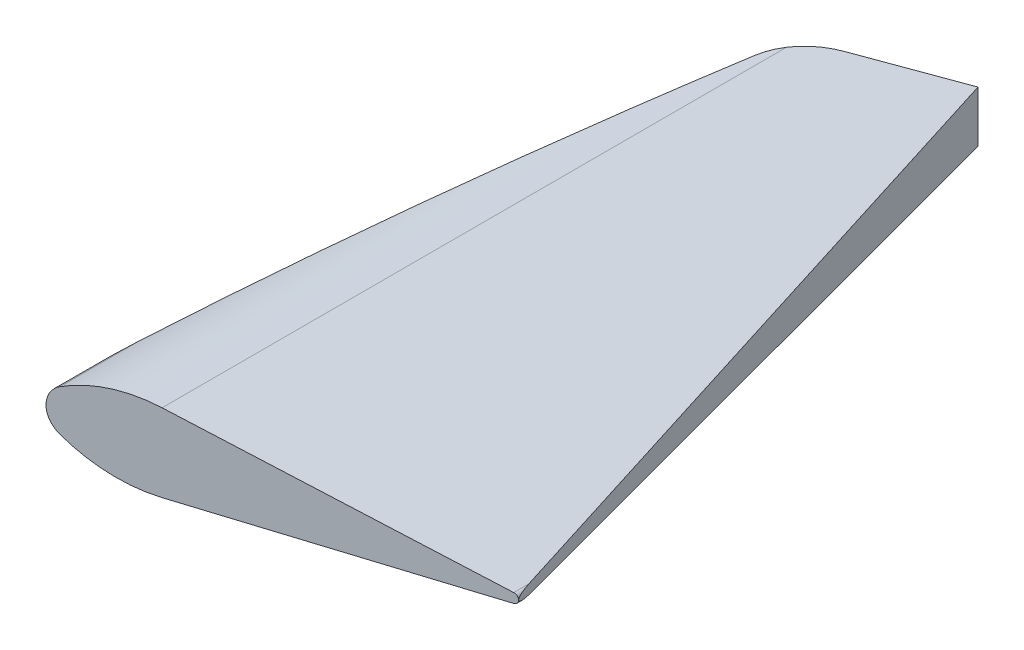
ISO-10303-21;
HEADER;
FILE_DESCRIPTION(('STEP AP214'),'2;1');
FILE_NAME('part.step','',(''),(''),'','','');
FILE_SCHEMA(('AUTOMOTIVE_DESIGN { 1 0 10303 214 1 1 1 1 }'));
ENDSEC;
DATA;
#1=APPLICATION_CONTEXT('core data for automotive mechanical design processes');
#2=APPLICATION_PROTOCOL_DEFINITION('international standard','automotive_design',2000,#1);
#3=PRODUCT_CONTEXT('',#1,'mechanical');
#4=PRODUCT('Part','Part','',(#3));
#5=PRODUCT_RELATED_PRODUCT_CATEGORY('part','',(#4));
#6=PRODUCT_DEFINITION_FORMATION('','',#4);
#7=PRODUCT_DEFINITION_CONTEXT('part definition',#1,'design');
#8=PRODUCT_DEFINITION('design','',#6,#7);
#9=PRODUCT_DEFINITION_SHAPE('','',#8);
#10=(LENGTH_UNIT() NAMED_UNIT(*) SI_UNIT(.MILLI.,.METRE.));
#11=(NAMED_UNIT(*) PLANE_ANGLE_UNIT() SI_UNIT($,.RADIAN.));
#12=(NAMED_UNIT(*) SI_UNIT($,.STERADIAN.) SOLID_ANGLE_UNIT());
#13=UNCERTAINTY_MEASURE_WITH_UNIT(LENGTH_MEASURE(1.E-05),#10,'distance_accuracy_value','');
#14=(GEOMETRIC_REPRESENTATION_CONTEXT(3) GLOBAL_UNCERTAINTY_ASSIGNED_CONTEXT((#13)) GLOBAL_UNIT_ASSIGNED_CONTEXT((#10,
#11,#12)) REPRESENTATION_CONTEXT('',''));
#15=CARTESIAN_POINT('',(0.,0.,0.));
#16=DIRECTION('',(0.,0.,1.));
#17=DIRECTION('',(1.,0.,0.));
#18=AXIS2_PLACEMENT_3D('',#15,#16,#17);
#19=CARTESIAN_POINT('',(-135.,-43.3012701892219,300.));
#20=DIRECTION('',(0.,0.,-1.));
#21=DIRECTION('',(-1.,0.,0.));
#22=AXIS2_PLACEMENT_3D('',#19,#20,#21);
#23=CYLINDRICAL_SURFACE('',#22,60.);
#24=CARTESIAN_POINT('',(-135.,-43.3012701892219,294.200519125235));
#25=DIRECTION('',(0.163470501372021,0.,0.986548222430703));
#26=DIRECTION('',(0.986548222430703,0.,-0.163470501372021));
#27=AXIS2_PLACEMENT_3D('',#24,#25,#26);
#28=ELLIPSE('',#27,60.81811171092,60.);
#29=CARTESIAN_POINT('',(-128.244792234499,16.3172434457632,293.081184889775));
#30=VERTEX_POINT('',#29);
#31=CARTESIAN_POINT('',(-165.,8.66025403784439,299.171502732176));
#32=VERTEX_POINT('',#31);
#33=EDGE_CURVE('E552',#30,#32,#28,.T.);
#34=ORIENTED_EDGE('',*,*,#33,.F.);
#35=DIRECTION('',(0.,0.,-1.));
#36=VECTOR('',#35,1.);
#37=CARTESIAN_POINT('',(-128.244792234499,16.3172434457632,300.));
#38=LINE('',#37,#36);
#39=CARTESIAN_POINT('',(-128.244792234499,16.3172434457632,31.2041543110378));
#40=VERTEX_POINT('',#39);
#41=EDGE_CURVE('E560',#30,#40,#38,.T.);
#42=ORIENTED_EDGE('',*,*,#41,.T.);
#43=CARTESIAN_POINT('',(-75.5409140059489,-51.3397459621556,59.8739081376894));
#44=CARTESIAN_POINT('',(-75.4878251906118,-50.9470469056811,59.7739917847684));
#45=CARTESIAN_POINT('',(-75.4384373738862,-50.5524343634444,59.6796779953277));
#46=CARTESIAN_POINT('',(-75.3472432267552,-49.7594477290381,59.5035518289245));
#47=CARTESIAN_POINT('',(-75.3054390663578,-49.3610725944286,59.4217430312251));
#48=CARTESIAN_POINT('',(-75.1916438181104,-48.1600003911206,59.1969626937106));
#49=CARTESIAN_POINT('',(-75.1313688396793,-47.3520831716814,59.0748268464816));
#50=CARTESIAN_POINT('',(-75.0442957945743,-45.7411314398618,58.8969278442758));
#51=CARTESIAN_POINT('',(-75.0169423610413,-44.938250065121,58.8400643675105));
#52=CARTESIAN_POINT('',(-74.9946264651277,-43.3305390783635,58.7937436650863));
#53=CARTESIAN_POINT('',(-74.9996430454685,-42.5257110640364,58.8042428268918));
#54=CARTESIAN_POINT('',(-75.0419906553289,-40.9160734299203,58.8918868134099));
#55=CARTESIAN_POINT('',(-75.0795046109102,-40.1112897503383,58.9694089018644));
#56=CARTESIAN_POINT('',(-75.1860785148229,-38.5119388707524,59.1852746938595));
#57=CARTESIAN_POINT('',(-75.2551502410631,-37.7173755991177,59.3236411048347));
#58=CARTESIAN_POINT('',(-75.4236806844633,-36.1392390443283,59.6522425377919));
#59=CARTESIAN_POINT('',(-75.5232584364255,-35.3557216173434,59.8426804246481));
#60=CARTESIAN_POINT('',(-75.7511845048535,-33.8042816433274,60.2646939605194));
#61=CARTESIAN_POINT('',(-75.8795334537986,-33.0363594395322,60.4962705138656));
#62=CARTESIAN_POINT('',(-76.1649609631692,-31.5094643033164,60.9930218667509));
#63=CARTESIAN_POINT('',(-76.3222780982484,-30.7506259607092,61.2584695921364));
#64=CARTESIAN_POINT('',(-76.6639775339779,-29.2477111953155,61.8129915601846));
#65=CARTESIAN_POINT('',(-76.8483660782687,-28.5036382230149,62.1020712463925));
#66=CARTESIAN_POINT('',(-77.2437252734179,-27.0287120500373,62.6971277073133));
#67=CARTESIAN_POINT('',(-77.4547186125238,-26.2978707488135,63.0031187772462));
#68=CARTESIAN_POINT('',(-77.9027875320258,-24.8490832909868,63.626090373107));
#69=CARTESIAN_POINT('',(-78.139861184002,-24.1311361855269,63.9430700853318));
#70=CARTESIAN_POINT('',(-78.6409937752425,-22.7042669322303,64.5847253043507));
#71=CARTESIAN_POINT('',(-78.905160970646,-21.9953948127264,64.9094273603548));
#72=CARTESIAN_POINT('',(-79.459662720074,-20.5891105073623,65.5613008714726));
#73=CARTESIAN_POINT('',(-79.7499975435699,-19.891698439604,65.8884723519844));
#74=CARTESIAN_POINT('',(-80.3568336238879,-18.5082336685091,66.5417452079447));
#75=CARTESIAN_POINT('',(-80.6733243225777,-17.8221765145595,66.8678469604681));
#76=CARTESIAN_POINT('',(-81.3327711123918,-16.4609929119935,67.5160768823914));
#77=CARTESIAN_POINT('',(-81.675727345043,-15.7858665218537,67.8382050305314));
#78=CARTESIAN_POINT('',(-82.4292745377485,-14.3697348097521,68.5122823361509));
#79=CARTESIAN_POINT('',(-82.8431108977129,-13.6300579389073,68.8634126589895));
#80=CARTESIAN_POINT('',(-83.7043444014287,-12.1648267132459,69.5535474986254));
#81=CARTESIAN_POINT('',(-84.1517422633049,-11.4392726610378,69.8925517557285));
#82=CARTESIAN_POINT('',(-85.5455342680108,-9.28386725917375,70.8863881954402));
#83=CARTESIAN_POINT('',(-86.5433645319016,-7.87557887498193,71.5178955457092));
#84=CARTESIAN_POINT('',(-88.141085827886,-5.81805189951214,72.3939435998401));
#85=CARTESIAN_POINT('',(-88.6891005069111,-5.14286486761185,72.6735236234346));
#86=CARTESIAN_POINT('',(-89.8196479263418,-3.81078056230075,73.205807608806));
#87=CARTESIAN_POINT('',(-90.4021827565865,-3.15388439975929,73.4585099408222));
#88=CARTESIAN_POINT('',(-91.600955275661,-1.8609590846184,73.932537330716));
#89=CARTESIAN_POINT('',(-92.2171616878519,-1.22491141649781,74.1538908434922));
#90=CARTESIAN_POINT('',(-93.4830727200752,0.0246515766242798,74.5609377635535));
#91=CARTESIAN_POINT('',(-94.1327696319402,0.638172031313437,74.7466393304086));
#92=CARTESIAN_POINT('',(-95.5147575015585,1.88551609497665,75.0900492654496));
#93=CARTESIAN_POINT('',(-96.2495876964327,2.5174076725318,75.2446106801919));
#94=CARTESIAN_POINT('',(-97.7545688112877,3.74894755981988,75.5006377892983));
#95=CARTESIAN_POINT('',(-98.5247130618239,4.34860191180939,75.6021134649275));
#96=CARTESIAN_POINT('',(-100.097002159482,5.51201369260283,75.7453875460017));
#97=CARTESIAN_POINT('',(-100.899142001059,6.07577670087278,75.7871952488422));
#98=CARTESIAN_POINT('',(-102.530727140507,7.1636464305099,75.8045235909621));
#99=CARTESIAN_POINT('',(-103.36017343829,7.68775169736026,75.780041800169));
#100=CARTESIAN_POINT('',(-105.04867661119,8.69771852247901,75.6577540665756));
#101=CARTESIAN_POINT('',(-105.907948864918,9.18313682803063,75.5592047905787));
#102=CARTESIAN_POINT('',(-107.206208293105,9.87528903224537,75.3514901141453));
#103=CARTESIAN_POINT('',(-107.640600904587,10.1000486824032,75.272249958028));
#104=CARTESIAN_POINT('',(-108.511316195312,10.5372541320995,75.0932002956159));
#105=CARTESIAN_POINT('',(-108.947638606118,10.7497015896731,74.9933935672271));
#106=CARTESIAN_POINT('',(-109.820631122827,11.1618576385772,74.772762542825));
#107=CARTESIAN_POINT('',(-110.257300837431,11.3615741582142,74.6519515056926));
#108=CARTESIAN_POINT('',(-111.12979510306,11.7481708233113,74.3888897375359));
#109=CARTESIAN_POINT('',(-111.565619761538,11.9350527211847,74.2466419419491));
#110=CARTESIAN_POINT('',(-112.434974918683,12.2958617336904,73.9404232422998));
#111=CARTESIAN_POINT('',(-112.868505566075,12.4697896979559,73.7764537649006));
#112=CARTESIAN_POINT('',(-113.731699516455,12.8046461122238,73.4266780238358));
#113=CARTESIAN_POINT('',(-114.161362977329,12.9655750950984,73.2408726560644));
#114=CARTESIAN_POINT('',(-115.323771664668,13.3860900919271,72.7052303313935));
#115=CARTESIAN_POINT('',(-116.051334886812,13.6330039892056,72.3338299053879));
#116=CARTESIAN_POINT('',(-117.482177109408,14.0894102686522,71.5271547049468));
#117=CARTESIAN_POINT('',(-118.185458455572,14.2989062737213,71.0918861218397));
#118=CARTESIAN_POINT('',(-119.559957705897,14.6824701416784,70.1596535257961));
#119=CARTESIAN_POINT('',(-120.231179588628,14.8565424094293,69.6626971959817));
#120=CARTESIAN_POINT('',(-121.534263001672,15.1720012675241,68.6102866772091));
#121=CARTESIAN_POINT('',(-122.166125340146,15.3133885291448,68.0548336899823));
#122=CARTESIAN_POINT('',(-123.339399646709,15.5575690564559,66.9320805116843));
#123=CARTESIAN_POINT('',(-123.884047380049,15.6624253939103,66.36860084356));
#124=CARTESIAN_POINT('',(-124.929151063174,15.8498912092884,65.1986721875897));
#125=CARTESIAN_POINT('',(-125.42960983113,15.9325021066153,64.5922259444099));
#126=CARTESIAN_POINT('',(-126.382326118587,16.0785921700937,63.3404270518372));
#127=CARTESIAN_POINT('',(-126.834582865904,16.1420710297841,62.695073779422));
#128=CARTESIAN_POINT('',(-127.687459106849,16.2530054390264,61.3697844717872));
#129=CARTESIAN_POINT('',(-128.088076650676,16.3004603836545,60.6898471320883));
#130=CARTESIAN_POINT('',(-128.845229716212,16.3834680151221,59.2804253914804));
#131=CARTESIAN_POINT('',(-129.200215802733,16.4186500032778,58.5500865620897));
#132=CARTESIAN_POINT('',(-129.849947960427,16.478186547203,57.0626697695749));
#133=CARTESIAN_POINT('',(-130.144693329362,16.5025409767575,56.3055914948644));
#134=CARTESIAN_POINT('',(-130.671902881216,16.5430071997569,54.7697370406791));
#135=CARTESIAN_POINT('',(-130.9043593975,16.5591179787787,53.9909582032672));
#136=CARTESIAN_POINT('',(-131.305350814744,16.5852054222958,52.4170115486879));
#137=CARTESIAN_POINT('',(-131.473884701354,16.5951819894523,51.6218434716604));
#138=CARTESIAN_POINT('',(-131.749967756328,16.6108075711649,49.9963884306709));
#139=CARTESIAN_POINT('',(-131.855537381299,16.6163178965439,49.1657632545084));
#140=CARTESIAN_POINT('',(-131.996900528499,16.6235694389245,47.4985704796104));
#141=CARTESIAN_POINT('',(-132.032692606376,16.6253105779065,46.6620027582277));
#142=CARTESIAN_POINT('',(-132.034245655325,16.6253875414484,44.98874206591));
#143=CARTESIAN_POINT('',(-132.000001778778,16.6237231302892,44.1520490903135));
#144=CARTESIAN_POINT('',(-131.861714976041,16.6166398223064,42.4844687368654));
#145=CARTESIAN_POINT('',(-131.757672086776,16.611220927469,41.6535813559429));
#146=CARTESIAN_POINT('',(-131.479601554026,16.595526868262,39.9979544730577));
#147=CARTESIAN_POINT('',(-131.305112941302,16.5852196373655,39.1732926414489));
#148=CARTESIAN_POINT('',(-130.887415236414,16.5579847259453,37.5416609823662));
#149=CARTESIAN_POINT('',(-130.644205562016,16.5410569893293,36.7346913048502));
#150=CARTESIAN_POINT('',(-130.090844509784,16.4982042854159,35.1442230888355));
#151=CARTESIAN_POINT('',(-129.780689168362,16.472278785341,34.3607259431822));
#152=CARTESIAN_POINT('',(-129.095797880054,16.4085163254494,32.8229807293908));
#153=CARTESIAN_POINT('',(-128.721062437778,16.3706794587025,32.0687324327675));
#154=CARTESIAN_POINT('',(-127.912148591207,16.2799937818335,30.5990513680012));
#155=CARTESIAN_POINT('',(-127.478301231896,16.2272269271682,29.8834314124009));
#156=CARTESIAN_POINT('',(-126.553189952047,16.103015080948,28.4920066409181));
#157=CARTESIAN_POINT('',(-126.061926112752,16.0315701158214,27.8162017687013));
#158=CARTESIAN_POINT('',(-125.026385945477,15.8663032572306,26.5097054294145));
#159=CARTESIAN_POINT('',(-124.482124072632,15.7724874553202,25.8790017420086));
#160=CARTESIAN_POINT('',(-123.345506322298,15.5587927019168,24.6672983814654));
#161=CARTESIAN_POINT('',(-122.753152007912,15.43891459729,24.0862970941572));
#162=CARTESIAN_POINT('',(-121.544463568,15.1736796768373,22.994814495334));
#163=CARTESIAN_POINT('',(-120.92937148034,15.0291893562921,22.4827467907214));
#164=CARTESIAN_POINT('',(-119.665355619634,14.7097071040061,21.5127481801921));
#165=CARTESIAN_POINT('',(-119.016432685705,14.5347159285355,21.0548159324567));
#166=CARTESIAN_POINT('',(-117.691454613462,14.1520980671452,20.1957710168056));
#167=CARTESIAN_POINT('',(-117.015407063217,13.9444804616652,19.7946425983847));
#168=CARTESIAN_POINT('',(-115.642905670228,13.4950696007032,19.0507214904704));
#169=CARTESIAN_POINT('',(-114.946452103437,13.2532768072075,18.7079280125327));
#170=CARTESIAN_POINT('',(-113.5602675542,12.7421763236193,18.0902863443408));
#171=CARTESIAN_POINT('',(-112.870912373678,12.473851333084,17.8137776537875));
#172=CARTESIAN_POINT('',(-111.485929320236,11.9042466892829,17.316105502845));
#173=CARTESIAN_POINT('',(-110.790301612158,11.602967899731,17.0949405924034));
#174=CARTESIAN_POINT('',(-109.398684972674,10.9680367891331,16.7067321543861));
#175=CARTESIAN_POINT('',(-108.702696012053,10.6343812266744,16.5396940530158));
#176=CARTESIAN_POINT('',(-107.315866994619,9.93585693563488,16.2577943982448));
#177=CARTESIAN_POINT('',(-106.625027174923,9.57098677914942,16.1429352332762));
#178=CARTESIAN_POINT('',(-105.214990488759,8.79036361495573,15.9577871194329));
#179=CARTESIAN_POINT('',(-104.496364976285,8.37290686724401,15.8903459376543));
#180=CARTESIAN_POINT('',(-103.075014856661,7.5070750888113,15.8071839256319));
#181=CARTESIAN_POINT('',(-102.372290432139,7.05869970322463,15.7914636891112));
#182=CARTESIAN_POINT('',(-100.986362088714,6.13320268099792,15.8078186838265));
#183=CARTESIAN_POINT('',(-100.303164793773,5.6560714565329,15.8399099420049));
#184=CARTESIAN_POINT('',(-98.9593635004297,4.67543840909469,15.947855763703));
#185=CARTESIAN_POINT('',(-98.2987645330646,4.17193077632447,16.0237200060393));
#186=CARTESIAN_POINT('',(-97.1537845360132,3.26123892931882,16.1928062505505));
#187=CARTESIAN_POINT('',(-96.6642391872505,2.85897906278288,16.2778528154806));
#188=CARTESIAN_POINT('',(-95.700664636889,2.04144139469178,16.4694636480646));
#189=CARTESIAN_POINT('',(-95.2266328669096,1.6261657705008,16.5760243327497));
#190=CARTESIAN_POINT('',(-93.828136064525,0.3617220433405,16.9254883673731));
#191=CARTESIAN_POINT('',(-92.9275173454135,-0.505865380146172,17.1981354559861));
#192=CARTESIAN_POINT('',(-91.1913973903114,-2.28474742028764,17.8100828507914));
#193=CARTESIAN_POINT('',(-90.3560308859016,-3.19612650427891,18.1495162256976));
#194=CARTESIAN_POINT('',(-88.753151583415,-5.05554094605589,18.8826935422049));
#195=CARTESIAN_POINT('',(-87.9856366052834,-6.00357512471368,19.276435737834));
#196=CARTESIAN_POINT('',(-86.1993876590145,-8.35100812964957,20.2878725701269));
#197=CARTESIAN_POINT('',(-85.216205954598,-9.76771763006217,20.9285945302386));
#198=CARTESIAN_POINT('',(-83.8437349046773,-11.9361751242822,21.9342890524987));
#199=CARTESIAN_POINT('',(-83.4031357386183,-12.6665337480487,22.2771050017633));
#200=CARTESIAN_POINT('',(-82.5555637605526,-14.1412928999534,22.974062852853));
#201=CARTESIAN_POINT('',(-82.1485899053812,-14.8856929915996,23.3282044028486));
#202=CARTESIAN_POINT('',(-81.3673721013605,-16.3891901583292,24.0445470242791));
#203=CARTESIAN_POINT('',(-80.9931750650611,-17.1483064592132,24.4067587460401));
#204=CARTESIAN_POINT('',(-80.2777800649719,-18.6802760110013,25.1347860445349));
#205=CARTESIAN_POINT('',(-79.9365833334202,-19.4531297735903,25.5006017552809));
#206=CARTESIAN_POINT('',(-79.2871318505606,-21.012497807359,26.2311952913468));
#207=CARTESIAN_POINT('',(-78.9788605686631,-21.7990049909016,26.5959735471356));
#208=CARTESIAN_POINT('',(-78.3950082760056,-23.386696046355,27.319493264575));
#209=CARTESIAN_POINT('',(-78.1194239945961,-24.1878784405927,27.6782353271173));
#210=CARTESIAN_POINT('',(-77.5727691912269,-25.8943398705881,28.4220244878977));
#211=CARTESIAN_POINT('',(-77.3054671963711,-26.801444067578,28.8056747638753));
#212=CARTESIAN_POINT('',(-76.8118005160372,-28.6371370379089,29.547467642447));
#213=CARTESIAN_POINT('',(-76.5854368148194,-29.5657263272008,29.9056096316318));
#214=CARTESIAN_POINT('',(-76.1757265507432,-31.442767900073,30.581376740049));
#215=CARTESIAN_POINT('',(-75.9922149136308,-32.3911281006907,30.8991551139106));
#216=CARTESIAN_POINT('',(-75.6691749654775,-34.3123330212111,31.4785576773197));
#217=CARTESIAN_POINT('',(-75.5296318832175,-35.2851693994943,31.7402007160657));
#218=CARTESIAN_POINT('',(-75.3236204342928,-37.0309097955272,32.1366033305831));
#219=CARTESIAN_POINT('',(-75.2477596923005,-37.7991940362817,32.2866789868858));
#220=CARTESIAN_POINT('',(-75.1254230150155,-39.3468890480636,32.5319804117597));
#221=CARTESIAN_POINT('',(-75.07894262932,-40.1262981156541,32.62721448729));
#222=CARTESIAN_POINT('',(-75.0164892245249,-41.6914185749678,32.7557959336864));
#223=CARTESIAN_POINT('',(-75.000512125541,-42.4771291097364,32.7891515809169));
#224=CARTESIAN_POINT('',(-74.9995124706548,-44.0485788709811,32.7912220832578));
#225=CARTESIAN_POINT('',(-75.0144837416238,-44.8343180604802,32.7599498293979));
#226=CARTESIAN_POINT('',(-75.0633990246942,-46.1011441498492,32.6592047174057));
#227=CARTESIAN_POINT('',(-75.0879410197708,-46.5842433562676,32.608826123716));
#228=CARTESIAN_POINT('',(-75.1484554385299,-47.5468604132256,32.4858980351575));
#229=CARTESIAN_POINT('',(-75.1844267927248,-48.0263785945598,32.4133506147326));
#230=CARTESIAN_POINT('',(-75.2675349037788,-48.9812825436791,32.247914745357));
#231=CARTESIAN_POINT('',(-75.3146809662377,-49.4566645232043,32.1550093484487));
#232=CARTESIAN_POINT('',(-75.4197776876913,-50.4022195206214,31.9511148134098));
#233=CARTESIAN_POINT('',(-75.4777256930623,-50.8723937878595,31.8401301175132));
#234=CARTESIAN_POINT('',(-75.5409140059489,-51.3397459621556,31.7211932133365));
#235=B_SPLINE_CURVE_WITH_KNOTS('',3,(#43,#44,#45,#46,#47,#48,#49,#50,#51,#52,#53,#54,#55,#56,
#57,#58,#59,#60,#61,#62,#63,#64,#65,#66,#67,#68,#69,#70,#71,#72,#73,#74,#75,#76,#77,#78,#79,#80,
#81,#82,#83,#84,#85,#86,#87,#88,#89,#90,#91,#92,#93,#94,#95,#96,#97,#98,#99,#100,#101,#102,#103,
#104,#105,#106,#107,#108,#109,#110,#111,#112,#113,#114,#115,#116,#117,#118,#119,#120,#121,#122,
#123,#124,#125,#126,#127,#128,#129,#130,#131,#132,#133,#134,#135,#136,#137,#138,#139,#140,#141,
#142,#143,#144,#145,#146,#147,#148,#149,#150,#151,#152,#153,#154,#155,#156,#157,#158,#159,#160,
#161,#162,#163,#164,#165,#166,#167,#168,#169,#170,#171,#172,#173,#174,#175,#176,#177,#178,#179,
#180,#181,#182,#183,#184,#185,#186,#187,#188,#189,#190,#191,#192,#193,#194,#195,#196,#197,#198,
#199,#200,#201,#202,#203,#204,#205,#206,#207,#208,#209,#210,#211,#212,#213,#214,#215,#216,#217,
#218,#219,#220,#221,#222,#223,#224,#225,#226,#227,#228,#229,#230,#231,#232,#233,#234),
.UNSPECIFIED.,.F.,.F.,(4,2,2,2,2,2,2,2,2,2,2,2,2,2,2,2,2,2,2,2,2,2,2,2,2,2,2,2,2,2,2,2,2,2,2,2,
2,2,2,2,2,2,2,2,2,2,2,2,2,2,2,2,2,2,2,2,2,2,2,2,2,2,2,2,2,2,2,2,2,2,2,2,2,2,2,2,2,2,2,2,2,2,2,2,
2,2,2,2,2,2,2,2,2,2,2,4),(0.,1.22591446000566,2.45217915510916,4.906974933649,7.31975176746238,
9.73096665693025,12.1558429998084,14.5816250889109,17.0169958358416,19.4524201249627,
21.9088802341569,24.3659077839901,26.8250450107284,29.2840005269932,31.7531951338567,
34.222415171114,36.6906433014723,39.1588846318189,41.9103092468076,44.6617927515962,
50.1658874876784,52.9052447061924,55.644767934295,58.3817883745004,61.1181816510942,
64.0599461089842,67.0011572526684,69.9419100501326,72.882770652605,75.853546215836,
77.3394820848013,78.8252173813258,80.3100181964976,81.7946158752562,83.2791160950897,
84.7635554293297,87.3199019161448,89.8760007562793,92.4317815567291,94.9875098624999,
97.3567891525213,99.7259172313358,102.095083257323,104.464338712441,106.89997087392,
109.335631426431,111.771591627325,114.207590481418,116.716611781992,119.225685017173,
121.734931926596,124.24417750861,126.770115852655,129.296075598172,131.82218493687,
134.348274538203,136.86075804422,139.373237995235,141.88503458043,144.396749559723,
146.833555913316,149.270301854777,151.706370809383,154.142406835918,156.508890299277,
158.875311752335,161.241970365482,163.608737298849,166.107698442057,168.606688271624,
171.106515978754,173.606896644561,175.524096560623,177.440977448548,181.27569332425,
185.118128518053,188.960440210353,194.470456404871,197.227718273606,199.984894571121,
202.74595476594,205.507118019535,208.266888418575,211.026382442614,214.086760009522,
217.147211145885,220.195670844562,223.243105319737,225.600349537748,227.957236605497,
230.313808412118,232.669910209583,234.128324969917,235.586603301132,237.046100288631,
238.505239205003),.UNSPECIFIED.);
#236=CARTESIAN_POINT('',(-131.709927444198,16.6084570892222,41.4033968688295));
#237=VERTEX_POINT('',#236);
#238=EDGE_CURVE('E379',#237,#40,#235,.T.);
#239=ORIENTED_EDGE('',*,*,#238,.F.);
#240=CARTESIAN_POINT('',(-135.,-43.3012701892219,63.6232969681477));
#241=DIRECTION('',(-0.989214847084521,0.,-0.146471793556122));
#242=DIRECTION('',(0.146471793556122,0.,-0.989214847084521));
#243=AXIS2_PLACEMENT_3D('',#240,#241,#242);
#244=ELLIPSE('',#243,409.635183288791,60.);
#245=CARTESIAN_POINT('',(-165.,8.66025403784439,266.231899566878));
#246=VERTEX_POINT('',#245);
#247=EDGE_CURVE('E547',#246,#237,#244,.T.);
#248=ORIENTED_EDGE('',*,*,#247,.F.);
#249=DIRECTION('',(0.,0.,-1.));
#250=VECTOR('',#249,1.);
#251=CARTESIAN_POINT('',(-165.,8.66025403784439,300.));
#252=LINE('',#251,#250);
#253=EDGE_CURVE('E556',#32,#246,#252,.T.);
#254=ORIENTED_EDGE('',*,*,#253,.F.);
#255=EDGE_LOOP('',(#34,#42,#239,#248,#254));
#256=FACE_BOUND('',#255,.T.);
#257=ADVANCED_FACE('F371',(#256),#23,.T.);
#258=CARTESIAN_POINT('',(-128.244792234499,16.3172434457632,300.));
#259=DIRECTION('',(-0.112586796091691,-0.993641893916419,0.));
#260=DIRECTION('',(0.993641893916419,-0.112586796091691,0.));
#261=AXIS2_PLACEMENT_3D('',#258,#259,#260);
#262=PLANE('',#261);
#263=DIRECTION('',(-0.980441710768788,0.111091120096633,0.162458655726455));
#264=VECTOR('',#263,1.);
#265=CARTESIAN_POINT('',(-129.346829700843,16.442112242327,293.263791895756));
#266=LINE('',#265,#264);
#267=CARTESIAN_POINT('',(-1.77482640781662,1.98728378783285,272.125180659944));
#268=VERTEX_POINT('',#267);
#269=EDGE_CURVE('E568',#268,#30,#266,.T.);
#270=ORIENTED_EDGE('',*,*,#269,.F.);
#271=DIRECTION('',(0.,0.,-1.));
#272=VECTOR('',#271,1.);
#273=CARTESIAN_POINT('',(-1.77482640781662,1.98728378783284,300.));
#274=LINE('',#273,#272);
#275=CARTESIAN_POINT('',(-1.77482640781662,1.98728378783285,265.739938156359));
#276=VERTEX_POINT('',#275);
#277=EDGE_CURVE('E530',#268,#276,#274,.T.);
#278=ORIENTED_EDGE('',*,*,#277,.T.);
#279=DIRECTION('',(0.279603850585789,-0.0316811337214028,0.959592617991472));
#280=VECTOR('',#279,1.);
#281=CARTESIAN_POINT('',(-2.59679919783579,2.08041923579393,262.918950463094));
#282=LINE('',#281,#280);
#283=CARTESIAN_POINT('',(-79.2055074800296,10.7607386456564,0.));
#284=VERTEX_POINT('',#283);
#285=EDGE_CURVE('E573',#284,#276,#282,.T.);
#286=ORIENTED_EDGE('',*,*,#285,.F.);
#287=DIRECTION('',(0.881660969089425,-0.099898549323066,-0.461187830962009));
#288=VECTOR('',#287,1.);
#289=CARTESIAN_POINT('',(-239.797813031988,28.9570056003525,84.0041917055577));
#290=LINE('',#289,#288);
#291=CARTESIAN_POINT('',(-115.938675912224,14.9228716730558,19.2147445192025));
#292=VERTEX_POINT('',#291);
#293=EDGE_CURVE('E455',#292,#284,#290,.T.);
#294=ORIENTED_EDGE('',*,*,#293,.F.);
#295=CARTESIAN_POINT('',(-102.033482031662,13.3473128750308,45.7975506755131));
#296=DIRECTION('',(-0.112586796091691,-0.993641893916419,0.));
#297=DIRECTION('',(0.993641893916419,-0.112586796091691,0.));
#298=AXIS2_PLACEMENT_3D('',#295,#296,#297);
#299=ELLIPSE('',#298,30.1919637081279,30.);
#300=EDGE_CURVE('E561',#40,#292,#299,.T.);
#301=ORIENTED_EDGE('',*,*,#300,.F.);
#302=ORIENTED_EDGE('',*,*,#41,.F.);
#303=EDGE_LOOP('',(#270,#278,#286,#294,#301,#302));
#304=FACE_BOUND('',#303,.T.);
#305=ADVANCED_FACE('F513',(#304),#262,.F.);
#306=CARTESIAN_POINT('',(-2.,0.,300.));
#307=DIRECTION('',(0.,0.,-1.));
#308=DIRECTION('',(-1.,0.,0.));
#309=AXIS2_PLACEMENT_3D('',#306,#307,#308);
#310=CYLINDRICAL_SURFACE('',#309,2.00000000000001);
#311=CARTESIAN_POINT('',(-2.,0.,272.162491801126));
#312=DIRECTION('',(0.163470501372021,0.,0.986548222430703));
#313=DIRECTION('',(0.986548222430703,0.,-0.163470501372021));
#314=AXIS2_PLACEMENT_3D('',#311,#312,#313);
#315=ELLIPSE('',#314,2.027270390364,2.00000000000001);
#316=CARTESIAN_POINT('',(0.,0.,271.831092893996));
#317=VERTEX_POINT('',#316);
#318=EDGE_CURVE('E566',#317,#268,#315,.T.);
#319=ORIENTED_EDGE('',*,*,#318,.F.);
#320=CARTESIAN_POINT('',(-2.,0.,264.967148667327));
#321=DIRECTION('',(0.960074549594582,0.,-0.279744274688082));
#322=DIRECTION('',(-0.279744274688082,0.,-0.960074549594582));
#323=AXIS2_PLACEMENT_3D('',#320,#321,#322);
#324=ELLIPSE('',#323,7.14938671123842,2.00000000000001);
#325=EDGE_CURVE('E394',#276,#317,#324,.T.);
#326=ORIENTED_EDGE('',*,*,#325,.F.);
#327=ORIENTED_EDGE('',*,*,#277,.F.);
#328=EDGE_LOOP('',(#319,#326,#327));
#329=FACE_BOUND('',#328,.T.);
#330=ADVANCED_FACE('F519',(#329),#310,.T.);
#331=CARTESIAN_POINT('',(-160.,0.,300.));
#332=DIRECTION('',(0.,0.,-1.));
#333=DIRECTION('',(-1.,0.,0.));
#334=AXIS2_PLACEMENT_3D('',#331,#332,#333);
#335=CYLINDRICAL_SURFACE('',#334,10.);
#336=CARTESIAN_POINT('',(-160.,0.,298.343005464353));
#337=DIRECTION('',(0.163470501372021,0.,0.986548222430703));
#338=DIRECTION('',(0.986548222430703,0.,-0.163470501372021));
#339=AXIS2_PLACEMENT_3D('',#336,#337,#338);
#340=ELLIPSE('',#339,10.13635195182,10.);
#341=CARTESIAN_POINT('',(-170.,0.,300.));
#342=VERTEX_POINT('',#341);
#343=EDGE_CURVE('E559',#32,#342,#340,.T.);
#344=ORIENTED_EDGE('',*,*,#343,.F.);
#345=ORIENTED_EDGE('',*,*,#253,.T.);
#346=CARTESIAN_POINT('',(-160.,0.,232.463799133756));
#347=DIRECTION('',(-0.989214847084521,0.,-0.146471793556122));
#348=DIRECTION('',(0.146471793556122,0.,-0.989214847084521));
#349=AXIS2_PLACEMENT_3D('',#346,#347,#348);
#350=ELLIPSE('',#349,68.2725305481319,10.);
#351=EDGE_CURVE('E545',#342,#246,#350,.T.);
#352=ORIENTED_EDGE('',*,*,#351,.F.);
#353=EDGE_LOOP('',(#344,#345,#352));
#354=FACE_BOUND('',#353,.T.);
#355=ADVANCED_FACE('F373',(#354),#335,.T.);
#356=CARTESIAN_POINT('',(-170.,16.6987298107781,300.));
#357=DIRECTION('',(-0.989214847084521,0.,-0.146471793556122));
#358=DIRECTION('',(-0.146471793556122,0.,0.989214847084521));
#359=AXIS2_PLACEMENT_3D('',#356,#357,#358);
#360=PLANE('',#359);
#361=ORIENTED_EDGE('',*,*,#351,.T.);
#362=ORIENTED_EDGE('',*,*,#247,.T.);
#363=DIRECTION('',(0.,-1.,0.));
#364=VECTOR('',#363,1.);
#365=CARTESIAN_POINT('',(-131.709927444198,16.6987298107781,41.4033968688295));
#366=LINE('',#365,#364);
#367=CARTESIAN_POINT('',(-131.709927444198,-16.6084570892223,41.4033968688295));
#368=VERTEX_POINT('',#367);
#369=EDGE_CURVE('E576',#237,#368,#366,.T.);
#370=ORIENTED_EDGE('',*,*,#369,.T.);
#371=CARTESIAN_POINT('',(-135.,43.3012701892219,63.6232969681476));
#372=DIRECTION('',(0.989214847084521,0.,0.146471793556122));
#373=DIRECTION('',(0.146471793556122,0.,-0.989214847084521));
#374=AXIS2_PLACEMENT_3D('',#371,#372,#373);
#375=ELLIPSE('',#374,409.635183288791,60.);
#376=CARTESIAN_POINT('',(-165.,-8.66025403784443,266.231899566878));
#377=VERTEX_POINT('',#376);
#378=EDGE_CURVE('E471',#368,#377,#375,.F.);
#379=ORIENTED_EDGE('',*,*,#378,.T.);
#380=CARTESIAN_POINT('',(-160.,0.,232.463799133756));
#381=DIRECTION('',(0.989214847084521,0.,0.146471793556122));
#382=DIRECTION('',(0.146471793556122,0.,-0.989214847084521));
#383=AXIS2_PLACEMENT_3D('',#380,#381,#382);
#384=ELLIPSE('',#383,68.2725305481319,10.);
#385=EDGE_CURVE('E386',#377,#342,#384,.F.);
#386=ORIENTED_EDGE('',*,*,#385,.T.);
#387=EDGE_LOOP('',(#361,#362,#370,#379,#386));
#388=FACE_BOUND('',#387,.T.);
#389=ADVANCED_FACE('F536',(#388),#360,.T.);
#390=CARTESIAN_POINT('',(-102.033482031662,16.6987298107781,45.7975506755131));
#391=DIRECTION('',(0.,-1.,0.));
#392=DIRECTION('',(1.,0.,0.));
#393=AXIS2_PLACEMENT_3D('',#390,#391,#392);
#394=CYLINDRICAL_SURFACE('',#393,30.);
#395=ORIENTED_EDGE('',*,*,#300,.T.);
#396=DIRECTION('',(0.,-1.,0.));
#397=VECTOR('',#396,1.);
#398=CARTESIAN_POINT('',(-115.938675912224,16.6987298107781,19.2147445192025));
#399=LINE('',#398,#397);
#400=CARTESIAN_POINT('',(-115.938675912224,-14.9228716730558,19.2147445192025));
#401=VERTEX_POINT('',#400);
#402=EDGE_CURVE('E457',#292,#401,#399,.T.);
#403=ORIENTED_EDGE('',*,*,#402,.T.);
#404=CARTESIAN_POINT('',(-102.033482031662,-13.3473128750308,45.7975506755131));
#405=DIRECTION('',(0.112586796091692,-0.993641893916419,0.));
#406=DIRECTION('',(0.993641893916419,0.112586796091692,0.));
#407=AXIS2_PLACEMENT_3D('',#404,#405,#406);
#408=ELLIPSE('',#407,30.1919637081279,30.);
#409=CARTESIAN_POINT('',(-128.244792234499,-16.3172434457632,31.2041543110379));
#410=VERTEX_POINT('',#409);
#411=EDGE_CURVE('E12',#401,#410,#408,.F.);
#412=ORIENTED_EDGE('',*,*,#411,.T.);
#413=CARTESIAN_POINT('',(-75.5409140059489,51.3397459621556,31.7211932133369));
#414=CARTESIAN_POINT('',(-75.4878251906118,50.947046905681,31.8211095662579));
#415=CARTESIAN_POINT('',(-75.4384373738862,50.5524343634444,31.9154233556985));
#416=CARTESIAN_POINT('',(-75.3472432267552,49.7594477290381,32.0915495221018));
#417=CARTESIAN_POINT('',(-75.3054390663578,49.3610725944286,32.1733583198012));
#418=CARTESIAN_POINT('',(-75.1916438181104,48.1600003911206,32.3981386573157));
#419=CARTESIAN_POINT('',(-75.1313688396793,47.3520831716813,32.5202745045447));
#420=CARTESIAN_POINT('',(-75.0442957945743,45.7411314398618,32.6981735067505));
#421=CARTESIAN_POINT('',(-75.0169423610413,44.938250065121,32.7550369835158));
#422=CARTESIAN_POINT('',(-74.9946264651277,43.3305390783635,32.80135768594));
#423=CARTESIAN_POINT('',(-74.9996430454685,42.5257110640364,32.7908585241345));
#424=CARTESIAN_POINT('',(-75.0419906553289,40.9160734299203,32.7032145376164));
#425=CARTESIAN_POINT('',(-75.0795046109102,40.1112897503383,32.6256924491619));
#426=CARTESIAN_POINT('',(-75.1860785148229,38.5119388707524,32.4098266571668));
#427=CARTESIAN_POINT('',(-75.2551502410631,37.7173755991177,32.2714602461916));
#428=CARTESIAN_POINT('',(-75.4236806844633,36.1392390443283,31.9428588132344));
#429=CARTESIAN_POINT('',(-75.5232584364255,35.3557216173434,31.7524209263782));
#430=CARTESIAN_POINT('',(-75.7511845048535,33.8042816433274,31.3304073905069));
#431=CARTESIAN_POINT('',(-75.8795334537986,33.0363594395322,31.0988308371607));
#432=CARTESIAN_POINT('',(-76.1649609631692,31.5094643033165,30.6020794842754));
#433=CARTESIAN_POINT('',(-76.3222780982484,30.7506259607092,30.3366317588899));
#434=CARTESIAN_POINT('',(-76.6639775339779,29.2477111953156,29.7821097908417));
#435=CARTESIAN_POINT('',(-76.8483660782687,28.5036382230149,29.4930301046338));
#436=CARTESIAN_POINT('',(-77.2437252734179,27.0287120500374,28.897973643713));
#437=CARTESIAN_POINT('',(-77.4547186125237,26.2978707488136,28.5919825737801));
#438=CARTESIAN_POINT('',(-77.9027875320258,24.8490832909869,27.9690109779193));
#439=CARTESIAN_POINT('',(-78.139861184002,24.1311361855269,27.6520312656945));
#440=CARTESIAN_POINT('',(-78.6409937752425,22.7042669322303,27.0103760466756));
#441=CARTESIAN_POINT('',(-78.9051609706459,21.9953948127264,26.6856739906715));
#442=CARTESIAN_POINT('',(-79.459662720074,20.5891105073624,26.0338004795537));
#443=CARTESIAN_POINT('',(-79.7499975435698,19.891698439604,25.7066289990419));
#444=CARTESIAN_POINT('',(-80.3568336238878,18.5082336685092,25.0533561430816));
#445=CARTESIAN_POINT('',(-80.6733243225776,17.8221765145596,24.7272543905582));
#446=CARTESIAN_POINT('',(-81.3327711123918,16.4609929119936,24.0790244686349));
#447=CARTESIAN_POINT('',(-81.6757273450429,15.7858665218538,23.756896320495));
#448=CARTESIAN_POINT('',(-82.4292745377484,14.3697348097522,23.0828190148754));
#449=CARTESIAN_POINT('',(-82.8431108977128,13.6300579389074,22.7316886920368));
#450=CARTESIAN_POINT('',(-83.7043444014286,12.164826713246,22.0415538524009));
#451=CARTESIAN_POINT('',(-84.1517422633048,11.4392726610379,21.7025495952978));
#452=CARTESIAN_POINT('',(-85.5455342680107,9.28386725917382,20.7087131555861));
#453=CARTESIAN_POINT('',(-86.5433645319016,7.87557887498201,20.0772058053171));
#454=CARTESIAN_POINT('',(-88.1410858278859,5.81805189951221,19.2011577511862));
#455=CARTESIAN_POINT('',(-88.689100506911,5.14286486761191,18.9215777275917));
#456=CARTESIAN_POINT('',(-89.8196479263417,3.81078056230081,18.3892937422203));
#457=CARTESIAN_POINT('',(-90.4021827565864,3.15388439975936,18.1365914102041));
#458=CARTESIAN_POINT('',(-91.6009552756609,1.86095908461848,17.6625640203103));
#459=CARTESIAN_POINT('',(-92.2171616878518,1.22491141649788,17.4412105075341));
#460=CARTESIAN_POINT('',(-93.4830727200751,-0.0246515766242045,17.0341635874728));
#461=CARTESIAN_POINT('',(-94.1327696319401,-0.638172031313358,16.8484620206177));
#462=CARTESIAN_POINT('',(-95.5147575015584,-1.88551609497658,16.5050520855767));
#463=CARTESIAN_POINT('',(-96.2495876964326,-2.51740767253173,16.3504906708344));
#464=CARTESIAN_POINT('',(-97.7545688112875,-3.74894755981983,16.0944635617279));
#465=CARTESIAN_POINT('',(-98.5247130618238,-4.34860191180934,15.9929878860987));
#466=CARTESIAN_POINT('',(-100.097002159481,-5.51201369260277,15.8497138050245));
#467=CARTESIAN_POINT('',(-100.899142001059,-6.07577670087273,15.8079061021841));
#468=CARTESIAN_POINT('',(-102.530727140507,-7.16364643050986,15.7905777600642));
#469=CARTESIAN_POINT('',(-103.36017343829,-7.68775169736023,15.8150595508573));
#470=CARTESIAN_POINT('',(-105.04867661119,-8.69771852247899,15.9373472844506));
#471=CARTESIAN_POINT('',(-105.907948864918,-9.1831368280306,16.0358965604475));
#472=CARTESIAN_POINT('',(-107.206208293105,-9.87528903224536,16.243611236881));
#473=CARTESIAN_POINT('',(-107.640600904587,-10.1000486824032,16.3228513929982));
#474=CARTESIAN_POINT('',(-108.511316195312,-10.5372541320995,16.5019010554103));
#475=CARTESIAN_POINT('',(-108.947638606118,-10.7497015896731,16.6017077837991));
#476=CARTESIAN_POINT('',(-109.820631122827,-11.1618576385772,16.8223388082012));
#477=CARTESIAN_POINT('',(-110.257300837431,-11.3615741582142,16.9431498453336));
#478=CARTESIAN_POINT('',(-111.129795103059,-11.7481708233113,17.2062116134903));
#479=CARTESIAN_POINT('',(-111.565619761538,-11.9350527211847,17.3484594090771));
#480=CARTESIAN_POINT('',(-112.434974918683,-12.2958617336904,17.6546781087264));
#481=CARTESIAN_POINT('',(-112.868505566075,-12.4697896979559,17.8186475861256));
#482=CARTESIAN_POINT('',(-113.731699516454,-12.8046461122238,18.1684233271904));
#483=CARTESIAN_POINT('',(-114.161362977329,-12.9655750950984,18.3542286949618));
#484=CARTESIAN_POINT('',(-115.323771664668,-13.3860900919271,18.8898710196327));
#485=CARTESIAN_POINT('',(-116.051334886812,-13.6330039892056,19.2612714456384));
#486=CARTESIAN_POINT('',(-117.482177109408,-14.0894102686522,20.0679466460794));
#487=CARTESIAN_POINT('',(-118.185458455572,-14.2989062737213,20.5032152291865));
#488=CARTESIAN_POINT('',(-119.559957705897,-14.6824701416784,21.4354478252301));
#489=CARTESIAN_POINT('',(-120.231179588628,-14.8565424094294,21.9324041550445));
#490=CARTESIAN_POINT('',(-121.534263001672,-15.1720012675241,22.9848146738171));
#491=CARTESIAN_POINT('',(-122.166125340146,-15.3133885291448,23.5402676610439));
#492=CARTESIAN_POINT('',(-123.339399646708,-15.5575690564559,24.6630208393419));
#493=CARTESIAN_POINT('',(-123.884047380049,-15.6624253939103,25.2265005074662));
#494=CARTESIAN_POINT('',(-124.929151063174,-15.8498912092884,26.3964291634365));
#495=CARTESIAN_POINT('',(-125.42960983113,-15.9325021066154,27.0028754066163));
#496=CARTESIAN_POINT('',(-126.382326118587,-16.0785921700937,28.254674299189));
#497=CARTESIAN_POINT('',(-126.834582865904,-16.1420710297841,28.9000275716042));
#498=CARTESIAN_POINT('',(-127.687459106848,-16.2530054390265,30.225316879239));
#499=CARTESIAN_POINT('',(-128.088076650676,-16.3004603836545,30.9052542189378));
#500=CARTESIAN_POINT('',(-128.845229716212,-16.3834680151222,32.3146759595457));
#501=CARTESIAN_POINT('',(-129.200215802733,-16.4186500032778,33.0450147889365));
#502=CARTESIAN_POINT('',(-129.849947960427,-16.478186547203,34.5324315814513));
#503=CARTESIAN_POINT('',(-130.144693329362,-16.5025409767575,35.2895098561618));
#504=CARTESIAN_POINT('',(-130.671902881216,-16.5430071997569,36.825364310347));
#505=CARTESIAN_POINT('',(-130.9043593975,-16.5591179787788,37.6041431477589));
#506=CARTESIAN_POINT('',(-131.305350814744,-16.5852054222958,39.1780898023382));
#507=CARTESIAN_POINT('',(-131.473884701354,-16.5951819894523,39.9732578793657));
#508=CARTESIAN_POINT('',(-131.749967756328,-16.610807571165,41.5987129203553));
#509=CARTESIAN_POINT('',(-131.855537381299,-16.6163178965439,42.4293380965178));
#510=CARTESIAN_POINT('',(-131.996900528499,-16.6235694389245,44.0965308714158));
#511=CARTESIAN_POINT('',(-132.032692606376,-16.6253105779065,44.9330985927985));
#512=CARTESIAN_POINT('',(-132.034245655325,-16.6253875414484,46.6063592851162));
#513=CARTESIAN_POINT('',(-132.000001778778,-16.6237231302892,47.4430522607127));
#514=CARTESIAN_POINT('',(-131.861714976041,-16.6166398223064,49.1106326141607));
#515=CARTESIAN_POINT('',(-131.757672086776,-16.611220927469,49.9415199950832));
#516=CARTESIAN_POINT('',(-131.479601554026,-16.595526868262,51.5971468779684));
#517=CARTESIAN_POINT('',(-131.305112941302,-16.5852196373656,52.4218087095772));
#518=CARTESIAN_POINT('',(-130.887415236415,-16.5579847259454,54.0534403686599));
#519=CARTESIAN_POINT('',(-130.644205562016,-16.5410569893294,54.8604100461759));
#520=CARTESIAN_POINT('',(-130.090844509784,-16.4982042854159,56.4508782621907));
#521=CARTESIAN_POINT('',(-129.780689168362,-16.4722787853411,57.234375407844));
#522=CARTESIAN_POINT('',(-129.095797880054,-16.4085163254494,58.7721206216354));
#523=CARTESIAN_POINT('',(-128.721062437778,-16.3706794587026,59.5263689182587));
#524=CARTESIAN_POINT('',(-127.912148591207,-16.2799937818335,60.996049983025));
#525=CARTESIAN_POINT('',(-127.478301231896,-16.2272269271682,61.7116699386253));
#526=CARTESIAN_POINT('',(-126.553189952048,-16.103015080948,63.1030947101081));
#527=CARTESIAN_POINT('',(-126.061926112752,-16.0315701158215,63.7788995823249));
#528=CARTESIAN_POINT('',(-125.026385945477,-15.8663032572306,65.0853959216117));
#529=CARTESIAN_POINT('',(-124.482124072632,-15.7724874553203,65.7160996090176));
#530=CARTESIAN_POINT('',(-123.345506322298,-15.5587927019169,66.9278029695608));
#531=CARTESIAN_POINT('',(-122.753152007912,-15.43891459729,67.508804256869));
#532=CARTESIAN_POINT('',(-121.544463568,-15.1736796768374,68.6002868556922));
#533=CARTESIAN_POINT('',(-120.92937148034,-15.0291893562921,69.1123545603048));
#534=CARTESIAN_POINT('',(-119.665355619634,-14.7097071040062,70.0823531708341));
#535=CARTESIAN_POINT('',(-119.016432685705,-14.5347159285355,70.5402854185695));
#536=CARTESIAN_POINT('',(-117.691454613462,-14.1520980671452,71.3993303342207));
#537=CARTESIAN_POINT('',(-117.015407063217,-13.9444804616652,71.8004587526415));
#538=CARTESIAN_POINT('',(-115.642905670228,-13.4950696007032,72.5443798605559));
#539=CARTESIAN_POINT('',(-114.946452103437,-13.2532768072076,72.8871733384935));
#540=CARTESIAN_POINT('',(-113.5602675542,-12.7421763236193,73.5048150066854));
#541=CARTESIAN_POINT('',(-112.870912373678,-12.4738513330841,73.7813236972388));
#542=CARTESIAN_POINT('',(-111.485929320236,-11.904246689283,74.2789958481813));
#543=CARTESIAN_POINT('',(-110.790301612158,-11.602967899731,74.5001607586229));
#544=CARTESIAN_POINT('',(-109.398684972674,-10.9680367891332,74.8883691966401));
#545=CARTESIAN_POINT('',(-108.702696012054,-10.6343812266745,75.0554072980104));
#546=CARTESIAN_POINT('',(-107.315866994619,-9.93585693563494,75.3373069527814));
#547=CARTESIAN_POINT('',(-106.625027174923,-9.57098677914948,75.45216611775));
#548=CARTESIAN_POINT('',(-105.214990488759,-8.79036361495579,75.6373142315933));
#549=CARTESIAN_POINT('',(-104.496364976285,-8.37290686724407,75.7047554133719));
#550=CARTESIAN_POINT('',(-103.075014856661,-7.50707508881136,75.7879174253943));
#551=CARTESIAN_POINT('',(-102.372290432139,-7.05869970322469,75.8036376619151));
#552=CARTESIAN_POINT('',(-100.986362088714,-6.13320268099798,75.7872826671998));
#553=CARTESIAN_POINT('',(-100.303164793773,-5.65607145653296,75.7551914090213));
#554=CARTESIAN_POINT('',(-98.9593635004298,-4.67543840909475,75.6472455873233));
#555=CARTESIAN_POINT('',(-98.2987645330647,-4.17193077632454,75.571381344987));
#556=CARTESIAN_POINT('',(-97.1537845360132,-3.26123892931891,75.4022951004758));
#557=CARTESIAN_POINT('',(-96.6642391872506,-2.85897906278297,75.3172485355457));
#558=CARTESIAN_POINT('',(-95.700664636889,-2.04144139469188,75.1256377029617));
#559=CARTESIAN_POINT('',(-95.2266328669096,-1.6261657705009,75.0190770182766));
#560=CARTESIAN_POINT('',(-93.828136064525,-0.361722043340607,74.6696129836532));
#561=CARTESIAN_POINT('',(-92.9275173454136,0.50586538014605,74.3969658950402));
#562=CARTESIAN_POINT('',(-91.1913973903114,2.28474742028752,73.7850185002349));
#563=CARTESIAN_POINT('',(-90.3560308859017,3.1961265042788,73.4455851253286));
#564=CARTESIAN_POINT('',(-88.7531515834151,5.05554094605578,72.7124078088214));
#565=CARTESIAN_POINT('',(-87.9856366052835,6.00357512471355,72.3186656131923));
#566=CARTESIAN_POINT('',(-86.1993876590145,8.35100812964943,71.3072287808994));
#567=CARTESIAN_POINT('',(-85.2162059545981,9.76771763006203,70.6665068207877));
#568=CARTESIAN_POINT('',(-83.8437349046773,11.9361751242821,69.6608122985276));
#569=CARTESIAN_POINT('',(-83.4031357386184,12.6665337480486,69.317996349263));
#570=CARTESIAN_POINT('',(-82.5555637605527,14.1412928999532,68.6210384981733));
#571=CARTESIAN_POINT('',(-82.1485899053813,14.8856929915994,68.2668969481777));
#572=CARTESIAN_POINT('',(-81.3673721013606,16.389190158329,67.5505543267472));
#573=CARTESIAN_POINT('',(-80.9931750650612,17.1483064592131,67.1883426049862));
#574=CARTESIAN_POINT('',(-80.2777800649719,18.6802760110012,66.4603153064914));
#575=CARTESIAN_POINT('',(-79.9365833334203,19.4531297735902,66.0944995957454));
#576=CARTESIAN_POINT('',(-79.2871318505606,21.0124978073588,65.3639060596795));
#577=CARTESIAN_POINT('',(-78.9788605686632,21.7990049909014,64.9991278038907));
#578=CARTESIAN_POINT('',(-78.3950082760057,23.3866960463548,64.2756080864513));
#579=CARTESIAN_POINT('',(-78.1194239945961,24.1878784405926,63.9168660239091));
#580=CARTESIAN_POINT('',(-77.5727691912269,25.894339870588,63.1730768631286));
#581=CARTESIAN_POINT('',(-77.3054671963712,26.8014440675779,62.789426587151));
#582=CARTESIAN_POINT('',(-76.8118005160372,28.6371370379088,62.0476337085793));
#583=CARTESIAN_POINT('',(-76.5854368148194,29.5657263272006,61.6894917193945));
#584=CARTESIAN_POINT('',(-76.1757265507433,31.4427679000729,61.0137246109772));
#585=CARTESIAN_POINT('',(-75.9922149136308,32.3911281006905,60.6959462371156));
#586=CARTESIAN_POINT('',(-75.6691749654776,34.312333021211,60.1165436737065));
#587=CARTESIAN_POINT('',(-75.5296318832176,35.2851693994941,59.8549006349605));
#588=CARTESIAN_POINT('',(-75.3236204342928,37.0309097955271,59.4584980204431));
#589=CARTESIAN_POINT('',(-75.2477596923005,37.7991940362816,59.3084223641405));
#590=CARTESIAN_POINT('',(-75.1254230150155,39.3468890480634,59.0631209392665));
#591=CARTESIAN_POINT('',(-75.07894262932,40.1262981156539,58.9678868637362));
#592=CARTESIAN_POINT('',(-75.0164892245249,41.6914185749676,58.8393054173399));
#593=CARTESIAN_POINT('',(-75.000512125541,42.4771291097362,58.8059497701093));
#594=CARTESIAN_POINT('',(-74.9995124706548,44.0485788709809,58.8038792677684));
#595=CARTESIAN_POINT('',(-75.0144837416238,44.8343180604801,58.8351515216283));
#596=CARTESIAN_POINT('',(-75.0633990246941,46.101144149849,58.9358966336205));
#597=CARTESIAN_POINT('',(-75.0879410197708,46.5842433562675,58.9862752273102));
#598=CARTESIAN_POINT('',(-75.1484554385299,47.5468604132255,59.1092033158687));
#599=CARTESIAN_POINT('',(-75.1844267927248,48.0263785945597,59.1817507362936));
#600=CARTESIAN_POINT('',(-75.2675349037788,48.981282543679,59.3471866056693));
#601=CARTESIAN_POINT('',(-75.3146809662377,49.4566645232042,59.4400920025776));
#602=CARTESIAN_POINT('',(-75.4197776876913,50.4022195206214,59.6439865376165));
#603=CARTESIAN_POINT('',(-75.4777256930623,50.8723937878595,59.754971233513));
#604=CARTESIAN_POINT('',(-75.5409140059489,51.3397459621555,59.8739081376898));
#605=B_SPLINE_CURVE_WITH_KNOTS('',3,(#413,#414,#415,#416,#417,#418,#419,#420,#421,#422,#423,
#424,#425,#426,#427,#428,#429,#430,#431,#432,#433,#434,#435,#436,#437,#438,#439,#440,#441,#442,
#443,#444,#445,#446,#447,#448,#449,#450,#451,#452,#453,#454,#455,#456,#457,#458,#459,#460,#461,
#462,#463,#464,#465,#466,#467,#468,#469,#470,#471,#472,#473,#474,#475,#476,#477,#478,#479,#480,
#481,#482,#483,#484,#485,#486,#487,#488,#489,#490,#491,#492,#493,#494,#495,#496,#497,#498,#499,
#500,#501,#502,#503,#504,#505,#506,#507,#508,#509,#510,#511,#512,#513,#514,#515,#516,#517,#518,
#519,#520,#521,#522,#523,#524,#525,#526,#527,#528,#529,#530,#531,#532,#533,#534,#535,#536,#537,
#538,#539,#540,#541,#542,#543,#544,#545,#546,#547,#548,#549,#550,#551,#552,#553,#554,#555,#556,
#557,#558,#559,#560,#561,#562,#563,#564,#565,#566,#567,#568,#569,#570,#571,#572,#573,#574,#575,
#576,#577,#578,#579,#580,#581,#582,#583,#584,#585,#586,#587,#588,#589,#590,#591,#592,#593,#594,
#595,#596,#597,#598,#599,#600,#601,#602,#603,#604),.UNSPECIFIED.,.F.,.F.,(4,2,2,2,2,2,2,2,2,2,2,
2,2,2,2,2,2,2,2,2,2,2,2,2,2,2,2,2,2,2,2,2,2,2,2,2,2,2,2,2,2,2,2,2,2,2,2,2,2,2,2,2,2,2,2,2,2,2,2,
2,2,2,2,2,2,2,2,2,2,2,2,2,2,2,2,2,2,2,2,2,2,2,2,2,2,2,2,2,2,2,2,2,2,2,2,4),(0.,1.22591446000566,
2.45217915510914,4.90697493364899,7.31975176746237,9.73096665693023,12.1558429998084,
14.5816250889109,17.0169958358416,19.4524201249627,21.9088802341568,24.36590778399,
26.8250450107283,29.2840005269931,31.7531951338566,34.2224151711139,36.6906433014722,
39.1588846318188,41.9103092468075,44.6617927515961,50.1658874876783,52.9052447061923,
55.6447679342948,58.3817883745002,61.118181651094,64.059946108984,67.0011572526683,
69.9419100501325,72.8827706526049,75.8535462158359,77.3394820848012,78.8252173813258,
80.3100181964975,81.7946158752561,83.2791160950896,84.7635554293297,87.3199019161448,
89.8760007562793,92.431781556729,94.9875098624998,97.3567891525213,99.7259172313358,
102.095083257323,104.464338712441,106.89997087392,109.335631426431,111.771591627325,
114.207590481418,116.716611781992,119.225685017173,121.734931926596,124.24417750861,
126.770115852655,129.296075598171,131.82218493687,134.348274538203,136.86075804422,
139.373237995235,141.88503458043,144.396749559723,146.833555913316,149.270301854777,
151.706370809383,154.142406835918,156.508890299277,158.875311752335,161.241970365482,
163.608737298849,166.107698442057,168.606688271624,171.106515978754,173.606896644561,
175.524096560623,177.440977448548,181.27569332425,185.118128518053,188.960440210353,
194.470456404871,197.227718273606,199.984894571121,202.74595476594,205.507118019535,
208.266888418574,211.026382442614,214.086760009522,217.147211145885,220.195670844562,
223.243105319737,225.600349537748,227.957236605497,230.313808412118,232.669910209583,
234.128324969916,235.586603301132,237.046100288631,238.505239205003),.UNSPECIFIED.);
#606=EDGE_CURVE('E486',#410,#368,#605,.T.);
#607=ORIENTED_EDGE('',*,*,#606,.T.);
#608=ORIENTED_EDGE('',*,*,#369,.F.);
#609=ORIENTED_EDGE('',*,*,#238,.T.);
#610=EDGE_LOOP('',(#395,#403,#412,#607,#608,#609));
#611=FACE_BOUND('',#610,.T.);
#612=ADVANCED_FACE('F532',(#611),#394,.T.);
#613=CARTESIAN_POINT('',(-115.938675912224,16.6987298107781,19.2147445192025));
#614=DIRECTION('',(-0.463506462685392,0.,-0.886093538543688));
#615=DIRECTION('',(-0.886093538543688,0.,0.463506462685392));
#616=AXIS2_PLACEMENT_3D('',#613,#614,#615);
#617=PLANE('',#616);
#618=ORIENTED_EDGE('',*,*,#293,.T.);
#619=DIRECTION('',(0.,-1.,0.));
#620=VECTOR('',#619,1.);
#621=CARTESIAN_POINT('',(-79.2055074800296,16.6987298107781,0.));
#622=LINE('',#621,#620);
#623=CARTESIAN_POINT('',(-79.2055074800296,-10.7607386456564,0.));
#624=VERTEX_POINT('',#623);
#625=EDGE_CURVE('E447',#284,#624,#622,.T.);
#626=ORIENTED_EDGE('',*,*,#625,.T.);
#627=DIRECTION('',(-0.881660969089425,-0.0998985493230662,0.461187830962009));
#628=VECTOR('',#627,1.);
#629=CARTESIAN_POINT('',(-239.797813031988,-28.9570056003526,84.0041917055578));
#630=LINE('',#629,#628);
#631=EDGE_CURVE('E452',#624,#401,#630,.T.);
#632=ORIENTED_EDGE('',*,*,#631,.T.);
#633=ORIENTED_EDGE('',*,*,#402,.F.);
#634=EDGE_LOOP('',(#618,#626,#632,#633));
#635=FACE_BOUND('',#634,.T.);
#636=ADVANCED_FACE('F449',(#635),#617,.T.);
#637=CARTESIAN_POINT('',(0.,16.6987298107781,271.831092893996));
#638=DIRECTION('',(0.960074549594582,0.,-0.279744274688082));
#639=DIRECTION('',(-0.279744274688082,0.,-0.960074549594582));
#640=AXIS2_PLACEMENT_3D('',#637,#638,#639);
#641=PLANE('',#640);
#642=ORIENTED_EDGE('',*,*,#325,.T.);
#643=CARTESIAN_POINT('',(-2.,0.,264.967148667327));
#644=DIRECTION('',(-0.960074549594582,0.,0.279744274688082));
#645=DIRECTION('',(-0.279744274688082,0.,-0.960074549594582));
#646=AXIS2_PLACEMENT_3D('',#643,#644,#645);
#647=ELLIPSE('',#646,7.14938671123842,2.00000000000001);
#648=CARTESIAN_POINT('',(-1.77482640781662,-1.98728378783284,265.739938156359));
#649=VERTEX_POINT('',#648);
#650=EDGE_CURVE('E463',#317,#649,#647,.F.);
#651=ORIENTED_EDGE('',*,*,#650,.T.);
#652=DIRECTION('',(-0.279603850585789,-0.0316811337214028,-0.959592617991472));
#653=VECTOR('',#652,1.);
#654=CARTESIAN_POINT('',(-2.59679919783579,-2.08041923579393,262.918950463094));
#655=LINE('',#654,#653);
#656=EDGE_CURVE('E460',#649,#624,#655,.T.);
#657=ORIENTED_EDGE('',*,*,#656,.T.);
#658=ORIENTED_EDGE('',*,*,#625,.F.);
#659=ORIENTED_EDGE('',*,*,#285,.T.);
#660=EDGE_LOOP('',(#642,#651,#657,#658,#659));
#661=FACE_BOUND('',#660,.T.);
#662=ADVANCED_FACE('F461',(#661),#641,.T.);
#663=CARTESIAN_POINT('',(-170.,16.6987298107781,300.));
#664=DIRECTION('',(0.163470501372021,0.,0.986548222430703));
#665=DIRECTION('',(0.986548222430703,0.,-0.163470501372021));
#666=AXIS2_PLACEMENT_3D('',#663,#664,#665);
#667=PLANE('',#666);
#668=ORIENTED_EDGE('',*,*,#343,.T.);
#669=CARTESIAN_POINT('',(-160.,0.,298.343005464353));
#670=DIRECTION('',(-0.163470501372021,0.,-0.986548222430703));
#671=DIRECTION('',(0.986548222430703,0.,-0.163470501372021));
#672=AXIS2_PLACEMENT_3D('',#669,#670,#671);
#673=ELLIPSE('',#672,10.13635195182,10.);
#674=CARTESIAN_POINT('',(-165.,-8.66025403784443,299.171502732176));
#675=VERTEX_POINT('',#674);
#676=EDGE_CURVE('E484',#342,#675,#673,.F.);
#677=ORIENTED_EDGE('',*,*,#676,.T.);
#678=CARTESIAN_POINT('',(-135.,43.3012701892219,294.200519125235));
#679=DIRECTION('',(-0.163470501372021,0.,-0.986548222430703));
#680=DIRECTION('',(0.986548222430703,0.,-0.163470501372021));
#681=AXIS2_PLACEMENT_3D('',#678,#679,#680);
#682=ELLIPSE('',#681,60.81811171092,60.);
#683=CARTESIAN_POINT('',(-128.244792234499,-16.3172434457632,293.081184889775));
#684=VERTEX_POINT('',#683);
#685=EDGE_CURVE('E482',#675,#684,#682,.F.);
#686=ORIENTED_EDGE('',*,*,#685,.T.);
#687=DIRECTION('',(0.980441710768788,0.111091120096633,-0.162458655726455));
#688=VECTOR('',#687,1.);
#689=CARTESIAN_POINT('',(-129.346829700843,-16.442112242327,293.263791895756));
#690=LINE('',#689,#688);
#691=CARTESIAN_POINT('',(-1.77482640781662,-1.98728378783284,272.125180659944));
#692=VERTEX_POINT('',#691);
#693=EDGE_CURVE('E480',#684,#692,#690,.T.);
#694=ORIENTED_EDGE('',*,*,#693,.T.);
#695=CARTESIAN_POINT('',(-2.,0.,272.162491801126));
#696=DIRECTION('',(-0.163470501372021,0.,-0.986548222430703));
#697=DIRECTION('',(0.986548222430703,0.,-0.163470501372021));
#698=AXIS2_PLACEMENT_3D('',#695,#696,#697);
#699=ELLIPSE('',#698,2.027270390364,2.00000000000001);
#700=EDGE_CURVE('E477',#692,#317,#699,.F.);
#701=ORIENTED_EDGE('',*,*,#700,.T.);
#702=ORIENTED_EDGE('',*,*,#318,.T.);
#703=ORIENTED_EDGE('',*,*,#269,.T.);
#704=ORIENTED_EDGE('',*,*,#33,.T.);
#705=EDGE_LOOP('',(#668,#677,#686,#694,#701,#702,#703,#704));
#706=FACE_BOUND('',#705,.T.);
#707=ADVANCED_FACE('F504',(#706),#667,.T.);
#708=CARTESIAN_POINT('',(-2.,0.,300.));
#709=DIRECTION('',(0.,0.,-1.));
#710=DIRECTION('',(-1.,0.,0.));
#711=AXIS2_PLACEMENT_3D('',#708,#709,#710);
#712=CYLINDRICAL_SURFACE('',#711,2.00000000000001);
#713=ORIENTED_EDGE('',*,*,#700,.F.);
#714=DIRECTION('',(0.,0.,-1.));
#715=VECTOR('',#714,1.);
#716=CARTESIAN_POINT('',(-1.77482640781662,-1.98728378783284,300.));
#717=LINE('',#716,#715);
#718=EDGE_CURVE('E494',#692,#649,#717,.T.);
#719=ORIENTED_EDGE('',*,*,#718,.T.);
#720=ORIENTED_EDGE('',*,*,#650,.F.);
#721=EDGE_LOOP('',(#713,#719,#720));
#722=FACE_BOUND('',#721,.T.);
#723=ADVANCED_FACE('F502',(#722),#712,.T.);
#724=CARTESIAN_POINT('',(-128.244792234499,-16.3172434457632,300.));
#725=DIRECTION('',(0.112586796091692,-0.993641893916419,0.));
#726=DIRECTION('',(0.993641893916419,0.112586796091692,0.));
#727=AXIS2_PLACEMENT_3D('',#724,#725,#726);
#728=PLANE('',#727);
#729=ORIENTED_EDGE('',*,*,#693,.F.);
#730=DIRECTION('',(0.,0.,-1.));
#731=VECTOR('',#730,1.);
#732=CARTESIAN_POINT('',(-128.244792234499,-16.3172434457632,300.));
#733=LINE('',#732,#731);
#734=EDGE_CURVE('E581',#684,#410,#733,.T.);
#735=ORIENTED_EDGE('',*,*,#734,.T.);
#736=ORIENTED_EDGE('',*,*,#411,.F.);
#737=ORIENTED_EDGE('',*,*,#631,.F.);
#738=ORIENTED_EDGE('',*,*,#656,.F.);
#739=ORIENTED_EDGE('',*,*,#718,.F.);
#740=EDGE_LOOP('',(#729,#735,#736,#737,#738,#739));
#741=FACE_BOUND('',#740,.T.);
#742=ADVANCED_FACE('F469',(#741),#728,.T.);
#743=CARTESIAN_POINT('',(-135.,43.3012701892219,300.));
#744=DIRECTION('',(0.,0.,-1.));
#745=DIRECTION('',(-1.,0.,0.));
#746=AXIS2_PLACEMENT_3D('',#743,#744,#745);
#747=CYLINDRICAL_SURFACE('',#746,60.);
#748=ORIENTED_EDGE('',*,*,#685,.F.);
#749=DIRECTION('',(0.,0.,-1.));
#750=VECTOR('',#749,1.);
#751=CARTESIAN_POINT('',(-165.,-8.66025403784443,300.));
#752=LINE('',#751,#750);
#753=EDGE_CURVE('E578',#675,#377,#752,.T.);
#754=ORIENTED_EDGE('',*,*,#753,.T.);
#755=ORIENTED_EDGE('',*,*,#378,.F.);
#756=ORIENTED_EDGE('',*,*,#606,.F.);
#757=ORIENTED_EDGE('',*,*,#734,.F.);
#758=EDGE_LOOP('',(#748,#754,#755,#756,#757));
#759=FACE_BOUND('',#758,.T.);
#760=ADVANCED_FACE('F496',(#759),#747,.T.);
#761=CARTESIAN_POINT('',(-160.,0.,300.));
#762=DIRECTION('',(0.,0.,-1.));
#763=DIRECTION('',(-1.,0.,0.));
#764=AXIS2_PLACEMENT_3D('',#761,#762,#763);
#765=CYLINDRICAL_SURFACE('',#764,10.);
#766=ORIENTED_EDGE('',*,*,#676,.F.);
#767=ORIENTED_EDGE('',*,*,#385,.F.);
#768=ORIENTED_EDGE('',*,*,#753,.F.);
#769=EDGE_LOOP('',(#766,#767,#768));
#770=FACE_BOUND('',#769,.T.);
#771=ADVANCED_FACE('F510',(#770),#765,.T.);
#772=CLOSED_SHELL('',(#257,#305,#330,#355,#389,#612,#636,#662,#707,#723,#742,#760,#771));
#773=MANIFOLD_SOLID_BREP('B2',#772);
#774=ADVANCED_BREP_SHAPE_REPRESENTATION('',(#18,#773),#14);
#775=SHAPE_DEFINITION_REPRESENTATION(#9,#774);
ENDSEC;
END-ISO-10303-21;
